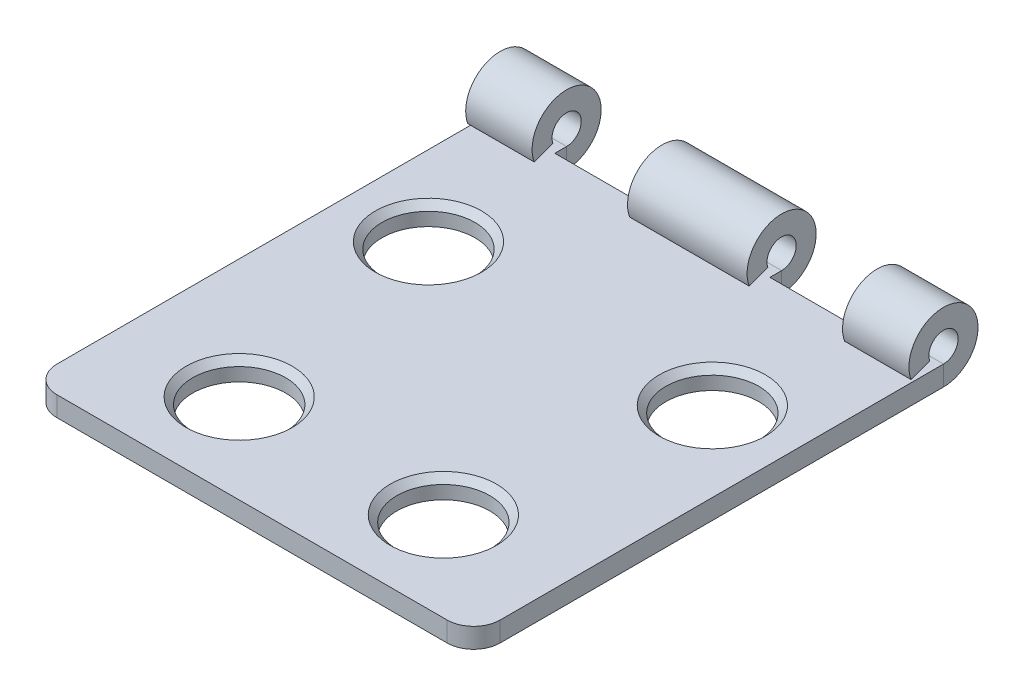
ISO-10303-21;
HEADER;
FILE_DESCRIPTION(('STEP AP214'),'2;1');
FILE_NAME('part.step','',(''),(''),'','','');
FILE_SCHEMA(('AUTOMOTIVE_DESIGN { 1 0 10303 214 1 1 1 1 }'));
ENDSEC;
DATA;
#1=APPLICATION_CONTEXT('core data for automotive mechanical design processes');
#2=APPLICATION_PROTOCOL_DEFINITION('international standard','automotive_design',2000,#1);
#3=PRODUCT_CONTEXT('',#1,'mechanical');
#4=PRODUCT('Part','Part','',(#3));
#5=PRODUCT_RELATED_PRODUCT_CATEGORY('part','',(#4));
#6=PRODUCT_DEFINITION_FORMATION('','',#4);
#7=PRODUCT_DEFINITION_CONTEXT('part definition',#1,'design');
#8=PRODUCT_DEFINITION('design','',#6,#7);
#9=PRODUCT_DEFINITION_SHAPE('','',#8);
#10=(LENGTH_UNIT() NAMED_UNIT(*) SI_UNIT(.MILLI.,.METRE.));
#11=(NAMED_UNIT(*) PLANE_ANGLE_UNIT() SI_UNIT($,.RADIAN.));
#12=(NAMED_UNIT(*) SI_UNIT($,.STERADIAN.) SOLID_ANGLE_UNIT());
#13=UNCERTAINTY_MEASURE_WITH_UNIT(LENGTH_MEASURE(1.E-05),#10,'distance_accuracy_value','');
#14=(GEOMETRIC_REPRESENTATION_CONTEXT(3) GLOBAL_UNCERTAINTY_ASSIGNED_CONTEXT((#13)) GLOBAL_UNIT_ASSIGNED_CONTEXT((#10,
#11,#12)) REPRESENTATION_CONTEXT('',''));
#15=CARTESIAN_POINT('',(0.,0.,0.));
#16=DIRECTION('',(0.,0.,1.));
#17=DIRECTION('',(1.,0.,0.));
#18=AXIS2_PLACEMENT_3D('',#15,#16,#17);
#19=CARTESIAN_POINT('',(7.47962647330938,-0.476257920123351,-7.75723216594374));
#20=DIRECTION('',(0.,1.,0.));
#21=DIRECTION('',(0.,0.,1.));
#22=AXIS2_PLACEMENT_3D('',#19,#20,#21);
#23=CONICAL_SURFACE('',#22,2.45,0.785398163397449);
#24=CARTESIAN_POINT('',(7.47962647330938,-0.126257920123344,-7.75723216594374));
#25=DIRECTION('',(0.,-1.,0.));
#26=DIRECTION('',(0.,0.,-1.));
#27=AXIS2_PLACEMENT_3D('',#24,#25,#26);
#28=CIRCLE('',#27,2.80000000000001);
#29=CARTESIAN_POINT('',(7.47962647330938,-0.126257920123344,-10.5572321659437));
#30=VERTEX_POINT('',#29);
#31=EDGE_CURVE('E249',#30,#30,#28,.T.);
#32=ORIENTED_EDGE('',*,*,#31,.F.);
#33=EDGE_LOOP('',(#32));
#34=FACE_BOUND('',#33,.T.);
#35=CARTESIAN_POINT('',(7.47962647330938,-0.476257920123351,-7.75723216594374));
#36=DIRECTION('',(0.,-1.,0.));
#37=DIRECTION('',(0.,0.,-1.));
#38=AXIS2_PLACEMENT_3D('',#35,#36,#37);
#39=CIRCLE('',#38,2.45);
#40=CARTESIAN_POINT('',(7.47962647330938,-0.476257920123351,-10.2072321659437));
#41=VERTEX_POINT('',#40);
#42=EDGE_CURVE('E313',#41,#41,#39,.F.);
#43=ORIENTED_EDGE('',*,*,#42,.F.);
#44=EDGE_LOOP('',(#43));
#45=FACE_BOUND('',#44,.T.);
#46=ADVANCED_FACE('F49',(#34,#45),#23,.F.);
#47=CARTESIAN_POINT('',(5.37962647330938,-0.47625792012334,4.31790996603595));
#48=DIRECTION('',(0.,1.,0.));
#49=DIRECTION('',(0.,0.,1.));
#50=AXIS2_PLACEMENT_3D('',#47,#48,#49);
#51=CONICAL_SURFACE('',#50,2.45,0.78539816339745);
#52=CARTESIAN_POINT('',(5.37962647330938,-0.126257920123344,4.31790996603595));
#53=DIRECTION('',(0.,-1.,0.));
#54=DIRECTION('',(0.,0.,-1.));
#55=AXIS2_PLACEMENT_3D('',#52,#53,#54);
#56=CIRCLE('',#55,2.8);
#57=CARTESIAN_POINT('',(5.37962647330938,-0.126257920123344,1.51790996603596));
#58=VERTEX_POINT('',#57);
#59=EDGE_CURVE('E252',#58,#58,#56,.T.);
#60=ORIENTED_EDGE('',*,*,#59,.F.);
#61=EDGE_LOOP('',(#60));
#62=FACE_BOUND('',#61,.T.);
#63=CARTESIAN_POINT('',(5.37962647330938,-0.47625792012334,4.31790996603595));
#64=DIRECTION('',(0.,-1.,0.));
#65=DIRECTION('',(0.,0.,-1.));
#66=AXIS2_PLACEMENT_3D('',#63,#64,#65);
#67=CIRCLE('',#66,2.45);
#68=CARTESIAN_POINT('',(5.37962647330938,-0.47625792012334,1.86790996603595));
#69=VERTEX_POINT('',#68);
#70=EDGE_CURVE('E316',#69,#69,#67,.F.);
#71=ORIENTED_EDGE('',*,*,#70,.F.);
#72=EDGE_LOOP('',(#71));
#73=FACE_BOUND('',#72,.T.);
#74=ADVANCED_FACE('F479',(#62,#73),#51,.F.);
#75=CARTESIAN_POINT('',(-5.37937352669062,-0.47625792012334,4.31790996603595));
#76=DIRECTION('',(0.,1.,0.));
#77=DIRECTION('',(0.,0.,1.));
#78=AXIS2_PLACEMENT_3D('',#75,#76,#77);
#79=CONICAL_SURFACE('',#78,2.45,0.78539816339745);
#80=CARTESIAN_POINT('',(-5.37937352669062,-0.126257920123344,4.31790996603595));
#81=DIRECTION('',(0.,-1.,0.));
#82=DIRECTION('',(0.,0.,-1.));
#83=AXIS2_PLACEMENT_3D('',#80,#81,#82);
#84=CIRCLE('',#83,2.8);
#85=CARTESIAN_POINT('',(-5.37937352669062,-0.126257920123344,1.51790996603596));
#86=VERTEX_POINT('',#85);
#87=EDGE_CURVE('E255',#86,#86,#84,.T.);
#88=ORIENTED_EDGE('',*,*,#87,.F.);
#89=EDGE_LOOP('',(#88));
#90=FACE_BOUND('',#89,.T.);
#91=CARTESIAN_POINT('',(-5.37937352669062,-0.47625792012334,4.31790996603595));
#92=DIRECTION('',(0.,-1.,0.));
#93=DIRECTION('',(0.,0.,-1.));
#94=AXIS2_PLACEMENT_3D('',#91,#92,#93);
#95=CIRCLE('',#94,2.45);
#96=CARTESIAN_POINT('',(-5.37937352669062,-0.47625792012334,1.86790996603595));
#97=VERTEX_POINT('',#96);
#98=EDGE_CURVE('E319',#97,#97,#95,.F.);
#99=ORIENTED_EDGE('',*,*,#98,.F.);
#100=EDGE_LOOP('',(#99));
#101=FACE_BOUND('',#100,.T.);
#102=ADVANCED_FACE('F485',(#90,#101),#79,.F.);
#103=CARTESIAN_POINT('',(-7.47937352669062,-0.476257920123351,-7.75723216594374));
#104=DIRECTION('',(0.,1.,0.));
#105=DIRECTION('',(0.,0.,1.));
#106=AXIS2_PLACEMENT_3D('',#103,#104,#105);
#107=CONICAL_SURFACE('',#106,2.45,0.785398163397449);
#108=CARTESIAN_POINT('',(-7.47937352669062,-0.126257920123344,-7.75723216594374));
#109=DIRECTION('',(0.,-1.,0.));
#110=DIRECTION('',(0.,0.,-1.));
#111=AXIS2_PLACEMENT_3D('',#108,#109,#110);
#112=CIRCLE('',#111,2.80000000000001);
#113=CARTESIAN_POINT('',(-7.47937352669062,-0.126257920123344,-10.5572321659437));
#114=VERTEX_POINT('',#113);
#115=EDGE_CURVE('E258',#114,#114,#112,.T.);
#116=ORIENTED_EDGE('',*,*,#115,.F.);
#117=EDGE_LOOP('',(#116));
#118=FACE_BOUND('',#117,.T.);
#119=CARTESIAN_POINT('',(-7.47937352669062,-0.476257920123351,-7.75723216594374));
#120=DIRECTION('',(0.,-1.,0.));
#121=DIRECTION('',(0.,0.,-1.));
#122=AXIS2_PLACEMENT_3D('',#119,#120,#121);
#123=CIRCLE('',#122,2.45);
#124=CARTESIAN_POINT('',(-7.47937352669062,-0.476257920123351,-10.2072321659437));
#125=VERTEX_POINT('',#124);
#126=EDGE_CURVE('E322',#125,#125,#123,.F.);
#127=ORIENTED_EDGE('',*,*,#126,.F.);
#128=EDGE_LOOP('',(#127));
#129=FACE_BOUND('',#128,.T.);
#130=ADVANCED_FACE('F493',(#118,#129),#107,.F.);
#131=CARTESIAN_POINT('',(-7.47937352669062,-1.17625792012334,-7.75723216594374));
#132=DIRECTION('',(0.,1.,0.));
#133=DIRECTION('',(0.,0.,1.));
#134=AXIS2_PLACEMENT_3D('',#131,#132,#133);
#135=CYLINDRICAL_SURFACE('',#134,2.45);
#136=ORIENTED_EDGE('',*,*,#126,.T.);
#137=EDGE_LOOP('',(#136));
#138=FACE_BOUND('',#137,.T.);
#139=CARTESIAN_POINT('',(-7.47937352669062,-1.17625792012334,-7.75723216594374));
#140=DIRECTION('',(0.,1.,0.));
#141=DIRECTION('',(0.,0.,1.));
#142=AXIS2_PLACEMENT_3D('',#139,#140,#141);
#143=CIRCLE('',#142,2.45);
#144=CARTESIAN_POINT('',(-7.47937352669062,-1.17625792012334,-5.30723216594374));
#145=VERTEX_POINT('',#144);
#146=EDGE_CURVE('E267',#145,#145,#143,.T.);
#147=ORIENTED_EDGE('',*,*,#146,.F.);
#148=EDGE_LOOP('',(#147));
#149=FACE_BOUND('',#148,.T.);
#150=ADVANCED_FACE('F497',(#138,#149),#135,.F.);
#151=CARTESIAN_POINT('',(-5.37937352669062,-1.17625792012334,4.31790996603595));
#152=DIRECTION('',(0.,1.,0.));
#153=DIRECTION('',(0.,0.,1.));
#154=AXIS2_PLACEMENT_3D('',#151,#152,#153);
#155=CYLINDRICAL_SURFACE('',#154,2.45);
#156=ORIENTED_EDGE('',*,*,#98,.T.);
#157=EDGE_LOOP('',(#156));
#158=FACE_BOUND('',#157,.T.);
#159=CARTESIAN_POINT('',(-5.37937352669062,-1.17625792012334,4.31790996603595));
#160=DIRECTION('',(0.,1.,0.));
#161=DIRECTION('',(0.,0.,1.));
#162=AXIS2_PLACEMENT_3D('',#159,#160,#161);
#163=CIRCLE('',#162,2.45);
#164=CARTESIAN_POINT('',(-5.37937352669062,-1.17625792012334,6.76790996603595));
#165=VERTEX_POINT('',#164);
#166=EDGE_CURVE('E270',#165,#165,#163,.T.);
#167=ORIENTED_EDGE('',*,*,#166,.F.);
#168=EDGE_LOOP('',(#167));
#169=FACE_BOUND('',#168,.T.);
#170=ADVANCED_FACE('F501',(#158,#169),#155,.F.);
#171=CARTESIAN_POINT('',(5.37962647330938,-1.17625792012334,4.31790996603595));
#172=DIRECTION('',(0.,1.,0.));
#173=DIRECTION('',(0.,0.,1.));
#174=AXIS2_PLACEMENT_3D('',#171,#172,#173);
#175=CYLINDRICAL_SURFACE('',#174,2.45);
#176=ORIENTED_EDGE('',*,*,#70,.T.);
#177=EDGE_LOOP('',(#176));
#178=FACE_BOUND('',#177,.T.);
#179=CARTESIAN_POINT('',(5.37962647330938,-1.17625792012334,4.31790996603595));
#180=DIRECTION('',(0.,1.,0.));
#181=DIRECTION('',(0.,0.,-1.));
#182=AXIS2_PLACEMENT_3D('',#179,#180,#181);
#183=CIRCLE('',#182,2.45);
#184=CARTESIAN_POINT('',(5.37962647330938,-1.17625792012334,1.86790996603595));
#185=VERTEX_POINT('',#184);
#186=EDGE_CURVE('E273',#185,#185,#183,.T.);
#187=ORIENTED_EDGE('',*,*,#186,.F.);
#188=EDGE_LOOP('',(#187));
#189=FACE_BOUND('',#188,.T.);
#190=ADVANCED_FACE('F505',(#178,#189),#175,.F.);
#191=CARTESIAN_POINT('',(7.47962647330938,-1.17625792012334,-7.75723216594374));
#192=DIRECTION('',(0.,1.,0.));
#193=DIRECTION('',(0.,0.,1.));
#194=AXIS2_PLACEMENT_3D('',#191,#192,#193);
#195=CYLINDRICAL_SURFACE('',#194,2.45);
#196=ORIENTED_EDGE('',*,*,#42,.T.);
#197=EDGE_LOOP('',(#196));
#198=FACE_BOUND('',#197,.T.);
#199=CARTESIAN_POINT('',(7.47962647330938,-1.17625792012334,-7.75723216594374));
#200=DIRECTION('',(0.,1.,0.));
#201=DIRECTION('',(0.,0.,-1.));
#202=AXIS2_PLACEMENT_3D('',#199,#200,#201);
#203=CIRCLE('',#202,2.45);
#204=CARTESIAN_POINT('',(7.47962647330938,-1.17625792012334,-10.2072321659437));
#205=VERTEX_POINT('',#204);
#206=EDGE_CURVE('E276',#205,#205,#203,.T.);
#207=ORIENTED_EDGE('',*,*,#206,.F.);
#208=EDGE_LOOP('',(#207));
#209=FACE_BOUND('',#208,.T.);
#210=ADVANCED_FACE('F509',(#198,#209),#195,.F.);
#211=CARTESIAN_POINT('',(3.15012647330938,-3.62625792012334,-15.1204572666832));
#212=DIRECTION('',(0.,0.,1.));
#213=DIRECTION('',(1.,0.,0.));
#214=AXIS2_PLACEMENT_3D('',#211,#212,#213);
#215=PLANE('',#214);
#216=DIRECTION('',(-1.,0.,0.));
#217=VECTOR('',#216,1.);
#218=CARTESIAN_POINT('',(-10.2793735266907,-1.17625792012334,-15.1204572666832));
#219=LINE('',#218,#217);
#220=CARTESIAN_POINT('',(8.17962647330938,-1.17625792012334,-15.1204572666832));
#221=VERTEX_POINT('',#220);
#222=CARTESIAN_POINT('',(3.15012647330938,-1.17625792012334,-15.1204572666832));
#223=VERTEX_POINT('',#222);
#224=EDGE_CURVE('E311',#221,#223,#219,.T.);
#225=ORIENTED_EDGE('',*,*,#224,.T.);
#226=DIRECTION('',(0.,1.,0.));
#227=VECTOR('',#226,1.);
#228=CARTESIAN_POINT('',(3.15012647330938,-3.62625792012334,-15.1204572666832));
#229=LINE('',#228,#227);
#230=CARTESIAN_POINT('',(3.15012647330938,-0.126257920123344,-15.1204572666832));
#231=VERTEX_POINT('',#230);
#232=EDGE_CURVE('E309',#223,#231,#229,.T.);
#233=ORIENTED_EDGE('',*,*,#232,.T.);
#234=DIRECTION('',(1.,0.,0.));
#235=VECTOR('',#234,1.);
#236=CARTESIAN_POINT('',(3.15012647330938,-0.126257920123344,-15.1204572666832));
#237=LINE('',#236,#235);
#238=CARTESIAN_POINT('',(8.17962647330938,-0.126257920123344,-15.1204572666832));
#239=VERTEX_POINT('',#238);
#240=EDGE_CURVE('E307',#231,#239,#237,.T.);
#241=ORIENTED_EDGE('',*,*,#240,.T.);
#242=DIRECTION('',(0.,1.,0.));
#243=VECTOR('',#242,1.);
#244=CARTESIAN_POINT('',(8.17962647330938,-3.62625792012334,-15.1204572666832));
#245=LINE('',#244,#243);
#246=EDGE_CURVE('E68',#221,#239,#245,.T.);
#247=ORIENTED_EDGE('',*,*,#246,.F.);
#248=EDGE_LOOP('',(#225,#233,#241,#247));
#249=FACE_BOUND('',#248,.T.);
#250=ADVANCED_FACE('F463',(#249),#215,.F.);
#251=CARTESIAN_POINT('',(-8.17937352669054,-3.62625792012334,-15.1144574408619));
#252=DIRECTION('',(0.,0.,1.));
#253=DIRECTION('',(1.,0.,0.));
#254=AXIS2_PLACEMENT_3D('',#251,#252,#253);
#255=PLANE('',#254);
#256=DIRECTION('',(-1.,0.,0.));
#257=VECTOR('',#256,1.);
#258=CARTESIAN_POINT('',(-10.2793735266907,-1.17625792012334,-15.1144574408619));
#259=LINE('',#258,#257);
#260=CARTESIAN_POINT('',(-3.14987352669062,-1.17625792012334,-15.1144574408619));
#261=VERTEX_POINT('',#260);
#262=CARTESIAN_POINT('',(-8.17937352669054,-1.17625792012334,-15.1144574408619));
#263=VERTEX_POINT('',#262);
#264=EDGE_CURVE('E305',#261,#263,#259,.T.);
#265=ORIENTED_EDGE('',*,*,#264,.T.);
#266=DIRECTION('',(0.,1.,0.));
#267=VECTOR('',#266,1.);
#268=CARTESIAN_POINT('',(-8.17937352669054,-3.62625792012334,-15.1144574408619));
#269=LINE('',#268,#267);
#270=CARTESIAN_POINT('',(-8.17937352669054,-0.126257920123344,-15.1144574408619));
#271=VERTEX_POINT('',#270);
#272=EDGE_CURVE('E303',#263,#271,#269,.T.);
#273=ORIENTED_EDGE('',*,*,#272,.T.);
#274=DIRECTION('',(1.,0.,0.));
#275=VECTOR('',#274,1.);
#276=CARTESIAN_POINT('',(-8.17937352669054,-0.126257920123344,-15.1144574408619));
#277=LINE('',#276,#275);
#278=CARTESIAN_POINT('',(-3.14987352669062,-0.126257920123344,-15.1144574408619));
#279=VERTEX_POINT('',#278);
#280=EDGE_CURVE('E300',#271,#279,#277,.T.);
#281=ORIENTED_EDGE('',*,*,#280,.T.);
#282=DIRECTION('',(0.,1.,0.));
#283=VECTOR('',#282,1.);
#284=CARTESIAN_POINT('',(-3.14987352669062,-3.62625792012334,-15.1144574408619));
#285=LINE('',#284,#283);
#286=EDGE_CURVE('E241',#261,#279,#285,.T.);
#287=ORIENTED_EDGE('',*,*,#286,.F.);
#288=EDGE_LOOP('',(#265,#273,#281,#287));
#289=FACE_BOUND('',#288,.T.);
#290=ADVANCED_FACE('F399',(#289),#255,.F.);
#291=CARTESIAN_POINT('',(-10.2793735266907,-7.12625792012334,7.62176783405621));
#292=DIRECTION('',(0.,1.,0.));
#293=DIRECTION('',(0.,0.,1.));
#294=AXIS2_PLACEMENT_3D('',#291,#292,#293);
#295=CYLINDRICAL_SURFACE('',#294,1.4);
#296=CARTESIAN_POINT('',(-10.2793735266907,-1.17625792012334,7.62176783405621));
#297=DIRECTION('',(0.,-1.,0.));
#298=DIRECTION('',(0.,0.,-1.));
#299=AXIS2_PLACEMENT_3D('',#296,#297,#298);
#300=CIRCLE('',#299,1.4);
#301=CARTESIAN_POINT('',(-10.2793735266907,-1.17625792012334,9.02176783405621));
#302=VERTEX_POINT('',#301);
#303=CARTESIAN_POINT('',(-11.6793735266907,-1.17625792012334,7.62176783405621));
#304=VERTEX_POINT('',#303);
#305=EDGE_CURVE('E286',#302,#304,#300,.T.);
#306=ORIENTED_EDGE('',*,*,#305,.F.);
#307=DIRECTION('',(0.,1.,0.));
#308=VECTOR('',#307,1.);
#309=CARTESIAN_POINT('',(-10.2793735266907,-7.12625792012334,9.02176783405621));
#310=LINE('',#309,#308);
#311=CARTESIAN_POINT('',(-10.2793735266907,-0.126257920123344,9.02176783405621));
#312=VERTEX_POINT('',#311);
#313=EDGE_CURVE('E290',#312,#302,#310,.F.);
#314=ORIENTED_EDGE('',*,*,#313,.F.);
#315=CARTESIAN_POINT('',(-10.2793735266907,-0.126257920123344,7.62176783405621));
#316=DIRECTION('',(0.,-1.,0.));
#317=DIRECTION('',(0.,0.,-1.));
#318=AXIS2_PLACEMENT_3D('',#315,#316,#317);
#319=CIRCLE('',#318,1.4);
#320=CARTESIAN_POINT('',(-11.6793735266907,-0.126257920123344,7.62176783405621));
#321=VERTEX_POINT('',#320);
#322=EDGE_CURVE('E245',#321,#312,#319,.F.);
#323=ORIENTED_EDGE('',*,*,#322,.F.);
#324=DIRECTION('',(0.,1.,0.));
#325=VECTOR('',#324,1.);
#326=CARTESIAN_POINT('',(-11.6793735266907,-7.12625792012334,7.62176783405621));
#327=LINE('',#326,#325);
#328=EDGE_CURVE('E59',#304,#321,#327,.T.);
#329=ORIENTED_EDGE('',*,*,#328,.F.);
#330=EDGE_LOOP('',(#306,#314,#323,#329));
#331=FACE_BOUND('',#330,.T.);
#332=ADVANCED_FACE('F518',(#331),#295,.T.);
#333=CARTESIAN_POINT('',(-11.6793735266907,-7.12625792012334,9.02176783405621));
#334=DIRECTION('',(0.,0.,-1.));
#335=DIRECTION('',(-1.,0.,0.));
#336=AXIS2_PLACEMENT_3D('',#333,#334,#335);
#337=PLANE('',#336);
#338=DIRECTION('',(1.,0.,0.));
#339=VECTOR('',#338,1.);
#340=CARTESIAN_POINT('',(-10.2793735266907,-1.17625792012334,9.02176783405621));
#341=LINE('',#340,#339);
#342=CARTESIAN_POINT('',(10.2796264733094,-1.17625792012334,9.02176783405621));
#343=VERTEX_POINT('',#342);
#344=EDGE_CURVE('E297',#302,#343,#341,.T.);
#345=ORIENTED_EDGE('',*,*,#344,.T.);
#346=DIRECTION('',(0.,-1.,0.));
#347=VECTOR('',#346,1.);
#348=CARTESIAN_POINT('',(10.2796264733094,-7.12625792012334,9.02176783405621));
#349=LINE('',#348,#347);
#350=CARTESIAN_POINT('',(10.2796264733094,-0.126257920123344,9.02176783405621));
#351=VERTEX_POINT('',#350);
#352=EDGE_CURVE('E295',#343,#351,#349,.F.);
#353=ORIENTED_EDGE('',*,*,#352,.T.);
#354=DIRECTION('',(-1.,0.,0.));
#355=VECTOR('',#354,1.);
#356=CARTESIAN_POINT('',(-11.6793735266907,-0.126257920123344,9.02176783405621));
#357=LINE('',#356,#355);
#358=EDGE_CURVE('E292',#351,#312,#357,.T.);
#359=ORIENTED_EDGE('',*,*,#358,.T.);
#360=ORIENTED_EDGE('',*,*,#313,.T.);
#361=EDGE_LOOP('',(#345,#353,#359,#360));
#362=FACE_BOUND('',#361,.T.);
#363=ADVANCED_FACE('F521',(#362),#337,.F.);
#364=CARTESIAN_POINT('',(10.2796264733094,-7.12625792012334,7.62176783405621));
#365=DIRECTION('',(0.,-1.,0.));
#366=DIRECTION('',(0.,0.,-1.));
#367=AXIS2_PLACEMENT_3D('',#364,#365,#366);
#368=CYLINDRICAL_SURFACE('',#367,1.4);
#369=CARTESIAN_POINT('',(10.2796264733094,-0.126257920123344,7.62176783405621));
#370=DIRECTION('',(0.,-1.,0.));
#371=DIRECTION('',(0.,0.,-1.));
#372=AXIS2_PLACEMENT_3D('',#369,#370,#371);
#373=CIRCLE('',#372,1.4);
#374=CARTESIAN_POINT('',(11.6796264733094,-0.126257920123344,7.62176783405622));
#375=VERTEX_POINT('',#374);
#376=EDGE_CURVE('E247',#351,#375,#373,.F.);
#377=ORIENTED_EDGE('',*,*,#376,.F.);
#378=ORIENTED_EDGE('',*,*,#352,.F.);
#379=CARTESIAN_POINT('',(10.2796264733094,-1.17625792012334,7.62176783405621));
#380=DIRECTION('',(0.,-1.,0.));
#381=DIRECTION('',(0.,0.,-1.));
#382=AXIS2_PLACEMENT_3D('',#379,#380,#381);
#383=CIRCLE('',#382,1.4);
#384=CARTESIAN_POINT('',(11.6796264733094,-1.17625792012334,7.62176783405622));
#385=VERTEX_POINT('',#384);
#386=EDGE_CURVE('E288',#385,#343,#383,.T.);
#387=ORIENTED_EDGE('',*,*,#386,.F.);
#388=DIRECTION('',(0.,-1.,0.));
#389=VECTOR('',#388,1.);
#390=CARTESIAN_POINT('',(11.6796264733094,-7.12625792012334,7.62176783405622));
#391=LINE('',#390,#389);
#392=EDGE_CURVE('E233',#375,#385,#391,.T.);
#393=ORIENTED_EDGE('',*,*,#392,.F.);
#394=EDGE_LOOP('',(#377,#378,#387,#393));
#395=FACE_BOUND('',#394,.T.);
#396=ADVANCED_FACE('F525',(#395),#368,.T.);
#397=CARTESIAN_POINT('',(-10.2793735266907,-1.17625792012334,10.1417678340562));
#398=DIRECTION('',(0.,-1.,0.));
#399=DIRECTION('',(0.,0.,-1.));
#400=AXIS2_PLACEMENT_3D('',#397,#398,#399);
#401=PLANE('',#400);
#402=DIRECTION('',(0.,0.,-1.));
#403=VECTOR('',#402,1.);
#404=CARTESIAN_POINT('',(11.6796264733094,-1.17625792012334,10.1417678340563));
#405=LINE('',#404,#403);
#406=CARTESIAN_POINT('',(11.6796264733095,-1.17625792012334,-15.7372321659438));
#407=VERTEX_POINT('',#406);
#408=EDGE_CURVE('E230',#385,#407,#405,.T.);
#409=ORIENTED_EDGE('',*,*,#408,.F.);
#410=ORIENTED_EDGE('',*,*,#386,.T.);
#411=ORIENTED_EDGE('',*,*,#344,.F.);
#412=ORIENTED_EDGE('',*,*,#305,.T.);
#413=DIRECTION('',(0.,0.,1.));
#414=VECTOR('',#413,1.);
#415=CARTESIAN_POINT('',(-11.6793735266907,-1.17625792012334,10.1417678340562));
#416=LINE('',#415,#414);
#417=CARTESIAN_POINT('',(-11.6793735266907,-1.17625792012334,-15.7372321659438));
#418=VERTEX_POINT('',#417);
#419=EDGE_CURVE('E147',#418,#304,#416,.T.);
#420=ORIENTED_EDGE('',*,*,#419,.F.);
#421=DIRECTION('',(1.,0.,0.));
#422=VECTOR('',#421,1.);
#423=CARTESIAN_POINT('',(-14.4793735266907,-1.17625792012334,-15.7372321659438));
#424=LINE('',#423,#422);
#425=CARTESIAN_POINT('',(-8.17937352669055,-1.17625792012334,-15.7372321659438));
#426=VERTEX_POINT('',#425);
#427=EDGE_CURVE('E284',#418,#426,#424,.T.);
#428=ORIENTED_EDGE('',*,*,#427,.T.);
#429=DIRECTION('',(0.,0.,-1.));
#430=VECTOR('',#429,1.);
#431=CARTESIAN_POINT('',(-8.17937352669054,-1.17625792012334,10.1417678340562));
#432=LINE('',#431,#430);
#433=EDGE_CURVE('E177',#263,#426,#432,.T.);
#434=ORIENTED_EDGE('',*,*,#433,.F.);
#435=ORIENTED_EDGE('',*,*,#264,.F.);
#436=DIRECTION('',(0.,0.,1.));
#437=VECTOR('',#436,1.);
#438=CARTESIAN_POINT('',(-3.14987352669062,-1.17625792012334,10.1417678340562));
#439=LINE('',#438,#437);
#440=CARTESIAN_POINT('',(-3.14987352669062,-1.17625792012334,-15.7372321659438));
#441=VERTEX_POINT('',#440);
#442=EDGE_CURVE('E243',#441,#261,#439,.T.);
#443=ORIENTED_EDGE('',*,*,#442,.F.);
#444=DIRECTION('',(1.,0.,0.));
#445=VECTOR('',#444,1.);
#446=CARTESIAN_POINT('',(-14.4793735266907,-1.17625792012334,-15.7372321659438));
#447=LINE('',#446,#445);
#448=CARTESIAN_POINT('',(3.15012647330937,-1.17625792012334,-15.7372321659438));
#449=VERTEX_POINT('',#448);
#450=EDGE_CURVE('E281',#441,#449,#447,.T.);
#451=ORIENTED_EDGE('',*,*,#450,.T.);
#452=DIRECTION('',(0.,0.,-1.));
#453=VECTOR('',#452,1.);
#454=CARTESIAN_POINT('',(3.15012647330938,-1.17625792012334,10.1417678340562));
#455=LINE('',#454,#453);
#456=EDGE_CURVE('E261',#223,#449,#455,.T.);
#457=ORIENTED_EDGE('',*,*,#456,.F.);
#458=ORIENTED_EDGE('',*,*,#224,.F.);
#459=DIRECTION('',(0.,0.,1.));
#460=VECTOR('',#459,1.);
#461=CARTESIAN_POINT('',(8.17962647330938,-1.17625792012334,10.1417678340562));
#462=LINE('',#461,#460);
#463=CARTESIAN_POINT('',(8.17962647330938,-1.17625792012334,-15.7372321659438));
#464=VERTEX_POINT('',#463);
#465=EDGE_CURVE('E228',#464,#221,#462,.T.);
#466=ORIENTED_EDGE('',*,*,#465,.F.);
#467=DIRECTION('',(1.,0.,0.));
#468=VECTOR('',#467,1.);
#469=CARTESIAN_POINT('',(-14.4793735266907,-1.17625792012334,-15.7372321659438));
#470=LINE('',#469,#468);
#471=EDGE_CURVE('E279',#464,#407,#470,.T.);
#472=ORIENTED_EDGE('',*,*,#471,.T.);
#473=EDGE_LOOP('',(#409,#410,#411,#412,#420,#428,#434,#435,#443,#451,#457,#458,#466,#472));
#474=FACE_BOUND('',#473,.T.);
#475=ORIENTED_EDGE('',*,*,#206,.T.);
#476=EDGE_LOOP('',(#475));
#477=FACE_BOUND('',#476,.T.);
#478=ORIENTED_EDGE('',*,*,#186,.T.);
#479=EDGE_LOOP('',(#478));
#480=FACE_BOUND('',#479,.T.);
#481=ORIENTED_EDGE('',*,*,#166,.T.);
#482=EDGE_LOOP('',(#481));
#483=FACE_BOUND('',#482,.T.);
#484=ORIENTED_EDGE('',*,*,#146,.T.);
#485=EDGE_LOOP('',(#484));
#486=FACE_BOUND('',#485,.T.);
#487=ADVANCED_FACE('F402',(#474,#477,#480,#483,#486),#401,.T.);
#488=CARTESIAN_POINT('',(3.15012647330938,-3.62625792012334,-22.2918161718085));
#489=DIRECTION('',(-1.,0.,0.));
#490=DIRECTION('',(0.,0.,1.));
#491=AXIS2_PLACEMENT_3D('',#488,#489,#490);
#492=PLANE('',#491);
#493=DIRECTION('',(0.,-1.,0.));
#494=VECTOR('',#493,1.);
#495=CARTESIAN_POINT('',(3.15012647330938,-0.126257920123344,-15.7372321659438));
#496=LINE('',#495,#494);
#497=CARTESIAN_POINT('',(3.15012647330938,-0.126257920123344,-15.7372321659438));
#498=VERTEX_POINT('',#497);
#499=EDGE_CURVE('E325',#498,#449,#496,.T.);
#500=ORIENTED_EDGE('',*,*,#499,.F.);
#501=DIRECTION('',(0.,0.,1.));
#502=VECTOR('',#501,1.);
#503=CARTESIAN_POINT('',(3.15012647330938,-0.126257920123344,-22.2918161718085));
#504=LINE('',#503,#502);
#505=EDGE_CURVE('E264',#498,#231,#504,.T.);
#506=ORIENTED_EDGE('',*,*,#505,.T.);
#507=ORIENTED_EDGE('',*,*,#232,.F.);
#508=ORIENTED_EDGE('',*,*,#456,.T.);
#509=EDGE_LOOP('',(#500,#506,#507,#508));
#510=FACE_BOUND('',#509,.T.);
#511=ADVANCED_FACE('F457',(#510),#492,.F.);
#512=CARTESIAN_POINT('',(-10.2793735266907,-0.126257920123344,10.1417678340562));
#513=DIRECTION('',(0.,-1.,0.));
#514=DIRECTION('',(0.,0.,-1.));
#515=AXIS2_PLACEMENT_3D('',#512,#513,#514);
#516=PLANE('',#515);
#517=ORIENTED_EDGE('',*,*,#115,.T.);
#518=EDGE_LOOP('',(#517));
#519=FACE_BOUND('',#518,.T.);
#520=ORIENTED_EDGE('',*,*,#87,.T.);
#521=EDGE_LOOP('',(#520));
#522=FACE_BOUND('',#521,.T.);
#523=ORIENTED_EDGE('',*,*,#59,.T.);
#524=EDGE_LOOP('',(#523));
#525=FACE_BOUND('',#524,.T.);
#526=ORIENTED_EDGE('',*,*,#31,.T.);
#527=EDGE_LOOP('',(#526));
#528=FACE_BOUND('',#527,.T.);
#529=ORIENTED_EDGE('',*,*,#358,.F.);
#530=ORIENTED_EDGE('',*,*,#376,.T.);
#531=DIRECTION('',(0.,0.,1.));
#532=VECTOR('',#531,1.);
#533=CARTESIAN_POINT('',(11.6796264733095,-0.126257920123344,-17.5572321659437));
#534=LINE('',#533,#532);
#535=CARTESIAN_POINT('',(11.6796264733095,-0.126257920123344,-15.7372321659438));
#536=VERTEX_POINT('',#535);
#537=EDGE_CURVE('E236',#536,#375,#534,.T.);
#538=ORIENTED_EDGE('',*,*,#537,.F.);
#539=DIRECTION('',(1.,0.,0.));
#540=VECTOR('',#539,1.);
#541=CARTESIAN_POINT('',(-14.4793735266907,-0.126257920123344,-15.7372321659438));
#542=LINE('',#541,#540);
#543=CARTESIAN_POINT('',(8.17962647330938,-0.126257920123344,-15.7372321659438));
#544=VERTEX_POINT('',#543);
#545=EDGE_CURVE('E335',#544,#536,#542,.T.);
#546=ORIENTED_EDGE('',*,*,#545,.F.);
#547=DIRECTION('',(0.,0.,-1.));
#548=VECTOR('',#547,1.);
#549=CARTESIAN_POINT('',(8.17962647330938,-0.126257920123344,-22.2918161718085));
#550=LINE('',#549,#548);
#551=EDGE_CURVE('E225',#239,#544,#550,.T.);
#552=ORIENTED_EDGE('',*,*,#551,.F.);
#553=ORIENTED_EDGE('',*,*,#240,.F.);
#554=ORIENTED_EDGE('',*,*,#505,.F.);
#555=DIRECTION('',(1.,0.,0.));
#556=VECTOR('',#555,1.);
#557=CARTESIAN_POINT('',(-14.4793735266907,-0.126257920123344,-15.7372321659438));
#558=LINE('',#557,#556);
#559=CARTESIAN_POINT('',(-3.14987352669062,-0.126257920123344,-15.7372321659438));
#560=VERTEX_POINT('',#559);
#561=EDGE_CURVE('E328',#560,#498,#558,.T.);
#562=ORIENTED_EDGE('',*,*,#561,.F.);
#563=DIRECTION('',(0.,0.,-1.));
#564=VECTOR('',#563,1.);
#565=CARTESIAN_POINT('',(-3.14987352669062,-0.126257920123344,-22.2918161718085));
#566=LINE('',#565,#564);
#567=EDGE_CURVE('E239',#279,#560,#566,.T.);
#568=ORIENTED_EDGE('',*,*,#567,.F.);
#569=ORIENTED_EDGE('',*,*,#280,.F.);
#570=DIRECTION('',(0.,0.,1.));
#571=VECTOR('',#570,1.);
#572=CARTESIAN_POINT('',(-8.17937352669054,-0.126257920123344,-22.2918161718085));
#573=LINE('',#572,#571);
#574=CARTESIAN_POINT('',(-8.17937352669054,-0.126257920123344,-15.7372321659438));
#575=VERTEX_POINT('',#574);
#576=EDGE_CURVE('E222',#575,#271,#573,.T.);
#577=ORIENTED_EDGE('',*,*,#576,.F.);
#578=DIRECTION('',(1.,0.,0.));
#579=VECTOR('',#578,1.);
#580=CARTESIAN_POINT('',(-14.4793735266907,-0.126257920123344,-15.7372321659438));
#581=LINE('',#580,#579);
#582=CARTESIAN_POINT('',(-11.6793735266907,-0.126257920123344,-15.7372321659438));
#583=VERTEX_POINT('',#582);
#584=EDGE_CURVE('E343',#583,#575,#581,.T.);
#585=ORIENTED_EDGE('',*,*,#584,.F.);
#586=DIRECTION('',(0.,0.,-1.));
#587=VECTOR('',#586,1.);
#588=CARTESIAN_POINT('',(-11.6793735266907,-0.126257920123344,-17.5572321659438));
#589=LINE('',#588,#587);
#590=EDGE_CURVE('E12',#321,#583,#589,.T.);
#591=ORIENTED_EDGE('',*,*,#590,.F.);
#592=ORIENTED_EDGE('',*,*,#322,.T.);
#593=EDGE_LOOP('',(#529,#530,#538,#546,#552,#553,#554,#562,#568,#569,#577,#585,#591,#592));
#594=FACE_BOUND('',#593,.T.);
#595=ADVANCED_FACE('F395',(#519,#522,#525,#528,#594),#516,.F.);
#596=CARTESIAN_POINT('',(-3.14987352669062,-3.62625792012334,-22.2918161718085));
#597=DIRECTION('',(1.,0.,0.));
#598=DIRECTION('',(0.,0.,-1.));
#599=AXIS2_PLACEMENT_3D('',#596,#597,#598);
#600=PLANE('',#599);
#601=DIRECTION('',(0.,1.,0.));
#602=VECTOR('',#601,1.);
#603=CARTESIAN_POINT('',(-3.14987352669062,-1.17625792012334,-15.7372321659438));
#604=LINE('',#603,#602);
#605=EDGE_CURVE('E331',#441,#560,#604,.T.);
#606=ORIENTED_EDGE('',*,*,#605,.F.);
#607=ORIENTED_EDGE('',*,*,#442,.T.);
#608=ORIENTED_EDGE('',*,*,#286,.T.);
#609=ORIENTED_EDGE('',*,*,#567,.T.);
#610=EDGE_LOOP('',(#606,#607,#608,#609));
#611=FACE_BOUND('',#610,.T.);
#612=ADVANCED_FACE('F409',(#611),#600,.F.);
#613=CARTESIAN_POINT('',(11.6796264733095,-7.12625792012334,-17.5572321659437));
#614=DIRECTION('',(-1.,0.,0.));
#615=DIRECTION('',(0.,0.,1.));
#616=AXIS2_PLACEMENT_3D('',#613,#614,#615);
#617=PLANE('',#616);
#618=DIRECTION('',(0.,-1.,0.));
#619=VECTOR('',#618,1.);
#620=CARTESIAN_POINT('',(11.6796264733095,-0.126257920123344,-15.7372321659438));
#621=LINE('',#620,#619);
#622=EDGE_CURVE('E203',#536,#407,#621,.T.);
#623=ORIENTED_EDGE('',*,*,#622,.F.);
#624=ORIENTED_EDGE('',*,*,#537,.T.);
#625=ORIENTED_EDGE('',*,*,#392,.T.);
#626=ORIENTED_EDGE('',*,*,#408,.T.);
#627=EDGE_LOOP('',(#623,#624,#625,#626));
#628=FACE_BOUND('',#627,.T.);
#629=ADVANCED_FACE('F539',(#628),#617,.F.);
#630=CARTESIAN_POINT('',(8.17962647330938,-3.62625792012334,-22.2918161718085));
#631=DIRECTION('',(1.,0.,0.));
#632=DIRECTION('',(0.,0.,-1.));
#633=AXIS2_PLACEMENT_3D('',#630,#631,#632);
#634=PLANE('',#633);
#635=DIRECTION('',(0.,1.,0.));
#636=VECTOR('',#635,1.);
#637=CARTESIAN_POINT('',(8.17962647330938,-1.17625792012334,-15.7372321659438));
#638=LINE('',#637,#636);
#639=EDGE_CURVE('E338',#464,#544,#638,.T.);
#640=ORIENTED_EDGE('',*,*,#639,.F.);
#641=ORIENTED_EDGE('',*,*,#465,.T.);
#642=ORIENTED_EDGE('',*,*,#246,.T.);
#643=ORIENTED_EDGE('',*,*,#551,.T.);
#644=EDGE_LOOP('',(#640,#641,#642,#643));
#645=FACE_BOUND('',#644,.T.);
#646=ADVANCED_FACE('F466',(#645),#634,.F.);
#647=CARTESIAN_POINT('',(-8.17937352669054,-3.62625792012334,-22.2918161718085));
#648=DIRECTION('',(-1.,0.,0.));
#649=DIRECTION('',(0.,0.,1.));
#650=AXIS2_PLACEMENT_3D('',#647,#648,#649);
#651=PLANE('',#650);
#652=DIRECTION('',(0.,-1.,0.));
#653=VECTOR('',#652,1.);
#654=CARTESIAN_POINT('',(-8.17937352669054,-0.126257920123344,-15.7372321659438));
#655=LINE('',#654,#653);
#656=EDGE_CURVE('E341',#575,#426,#655,.T.);
#657=ORIENTED_EDGE('',*,*,#656,.F.);
#658=ORIENTED_EDGE('',*,*,#576,.T.);
#659=ORIENTED_EDGE('',*,*,#272,.F.);
#660=ORIENTED_EDGE('',*,*,#433,.T.);
#661=EDGE_LOOP('',(#657,#658,#659,#660));
#662=FACE_BOUND('',#661,.T.);
#663=ADVANCED_FACE('F390',(#662),#651,.F.);
#664=CARTESIAN_POINT('',(-11.6793735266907,-7.12625792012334,-17.5572321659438));
#665=DIRECTION('',(1.,0.,0.));
#666=DIRECTION('',(0.,0.,-1.));
#667=AXIS2_PLACEMENT_3D('',#664,#665,#666);
#668=PLANE('',#667);
#669=DIRECTION('',(0.,1.,0.));
#670=VECTOR('',#669,1.);
#671=CARTESIAN_POINT('',(-11.6793735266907,-1.17625792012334,-15.7372321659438));
#672=LINE('',#671,#670);
#673=EDGE_CURVE('E53',#418,#583,#672,.T.);
#674=ORIENTED_EDGE('',*,*,#673,.F.);
#675=ORIENTED_EDGE('',*,*,#419,.T.);
#676=ORIENTED_EDGE('',*,*,#328,.T.);
#677=ORIENTED_EDGE('',*,*,#590,.T.);
#678=EDGE_LOOP('',(#674,#675,#676,#677));
#679=FACE_BOUND('',#678,.T.);
#680=ADVANCED_FACE('F51',(#679),#668,.F.);
#681=CARTESIAN_POINT('',(11.6796264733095,0.643742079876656,-15.7372321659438));
#682=DIRECTION('',(1.,0.,0.));
#683=DIRECTION('',(0.,0.,-1.));
#684=AXIS2_PLACEMENT_3D('',#681,#682,#683);
#685=PLANE('',#684);
#686=DIRECTION('',(0.,-0.342020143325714,0.939692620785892));
#687=VECTOR('',#686,1.);
#688=CARTESIAN_POINT('',(11.6796264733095,0.0212654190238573,-14.0269915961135));
#689=LINE('',#688,#687);
#690=CARTESIAN_POINT('',(11.6796264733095,0.380386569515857,-15.0136688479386));
#691=VERTEX_POINT('',#690);
#692=CARTESIAN_POINT('',(11.6796264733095,0.0212654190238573,-14.0269915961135));
#693=VERTEX_POINT('',#692);
#694=EDGE_CURVE('E168',#691,#693,#689,.T.);
#695=ORIENTED_EDGE('',*,*,#694,.F.);
#696=CARTESIAN_POINT('',(11.6796264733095,0.643742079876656,-15.7372321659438));
#697=DIRECTION('',(1.,0.,0.));
#698=DIRECTION('',(0.,0.,-1.));
#699=AXIS2_PLACEMENT_3D('',#696,#697,#698);
#700=CIRCLE('',#699,0.77);
#701=EDGE_CURVE('E215',#691,#536,#700,.F.);
#702=ORIENTED_EDGE('',*,*,#701,.T.);
#703=ORIENTED_EDGE('',*,*,#622,.T.);
#704=CARTESIAN_POINT('',(11.6796264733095,0.643742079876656,-15.7372321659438));
#705=DIRECTION('',(-1.,0.,0.));
#706=DIRECTION('',(0.,0.,-1.));
#707=AXIS2_PLACEMENT_3D('',#704,#705,#706);
#708=CIRCLE('',#707,1.82);
#709=EDGE_CURVE('E200',#693,#407,#708,.T.);
#710=ORIENTED_EDGE('',*,*,#709,.F.);
#711=EDGE_LOOP('',(#695,#702,#703,#710));
#712=FACE_BOUND('',#711,.T.);
#713=ADVANCED_FACE('F201',(#712),#685,.T.);
#714=CARTESIAN_POINT('',(8.17962647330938,0.643742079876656,-15.7372321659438));
#715=DIRECTION('',(-1.,0.,0.));
#716=DIRECTION('',(0.,0.,1.));
#717=AXIS2_PLACEMENT_3D('',#714,#715,#716);
#718=PLANE('',#717);
#719=ORIENTED_EDGE('',*,*,#639,.T.);
#720=CARTESIAN_POINT('',(8.17962647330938,0.643742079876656,-15.7372321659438));
#721=DIRECTION('',(1.,0.,0.));
#722=DIRECTION('',(0.,0.,-1.));
#723=AXIS2_PLACEMENT_3D('',#720,#721,#722);
#724=CIRCLE('',#723,0.77);
#725=CARTESIAN_POINT('',(8.17962647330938,0.380386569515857,-15.0136688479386));
#726=VERTEX_POINT('',#725);
#727=EDGE_CURVE('E213',#544,#726,#724,.T.);
#728=ORIENTED_EDGE('',*,*,#727,.T.);
#729=DIRECTION('',(0.,-0.342020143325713,0.939692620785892));
#730=VECTOR('',#729,1.);
#731=CARTESIAN_POINT('',(8.17962647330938,0.0212654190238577,-14.0269915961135));
#732=LINE('',#731,#730);
#733=CARTESIAN_POINT('',(8.17962647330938,0.0212654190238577,-14.0269915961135));
#734=VERTEX_POINT('',#733);
#735=EDGE_CURVE('E155',#726,#734,#732,.T.);
#736=ORIENTED_EDGE('',*,*,#735,.T.);
#737=CARTESIAN_POINT('',(8.17962647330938,0.643742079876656,-15.7372321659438));
#738=DIRECTION('',(1.,0.,0.));
#739=DIRECTION('',(0.,0.,-1.));
#740=AXIS2_PLACEMENT_3D('',#737,#738,#739);
#741=CIRCLE('',#740,1.82);
#742=EDGE_CURVE('E206',#464,#734,#741,.T.);
#743=ORIENTED_EDGE('',*,*,#742,.F.);
#744=EDGE_LOOP('',(#719,#728,#736,#743));
#745=FACE_BOUND('',#744,.T.);
#746=ADVANCED_FACE('F468',(#745),#718,.T.);
#747=CARTESIAN_POINT('',(9.92962647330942,0.0212654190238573,-14.0269915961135));
#748=DIRECTION('',(0.,-0.939692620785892,-0.342020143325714));
#749=DIRECTION('',(1.,0.,0.));
#750=AXIS2_PLACEMENT_3D('',#747,#748,#749);
#751=PLANE('',#750);
#752=DIRECTION('',(1.,0.,0.));
#753=VECTOR('',#752,1.);
#754=CARTESIAN_POINT('',(2.42528962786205,0.380386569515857,-15.0136688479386));
#755=LINE('',#754,#753);
#756=EDGE_CURVE('E196',#726,#691,#755,.T.);
#757=ORIENTED_EDGE('',*,*,#756,.T.);
#758=ORIENTED_EDGE('',*,*,#694,.T.);
#759=DIRECTION('',(1.,0.,0.));
#760=VECTOR('',#759,1.);
#761=CARTESIAN_POINT('',(8.17962647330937,0.0212654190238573,-14.0269915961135));
#762=LINE('',#761,#760);
#763=EDGE_CURVE('E194',#734,#693,#762,.T.);
#764=ORIENTED_EDGE('',*,*,#763,.F.);
#765=ORIENTED_EDGE('',*,*,#735,.F.);
#766=EDGE_LOOP('',(#757,#758,#764,#765));
#767=FACE_BOUND('',#766,.T.);
#768=ADVANCED_FACE('F192',(#767),#751,.T.);
#769=CARTESIAN_POINT('',(2.42528962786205,0.643742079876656,-15.7372321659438));
#770=DIRECTION('',(1.,0.,0.));
#771=DIRECTION('',(0.,0.,-1.));
#772=AXIS2_PLACEMENT_3D('',#769,#770,#771);
#773=CYLINDRICAL_SURFACE('',#772,1.82);
#774=ORIENTED_EDGE('',*,*,#742,.T.);
#775=ORIENTED_EDGE('',*,*,#763,.T.);
#776=ORIENTED_EDGE('',*,*,#709,.T.);
#777=ORIENTED_EDGE('',*,*,#471,.F.);
#778=EDGE_LOOP('',(#774,#775,#776,#777));
#779=FACE_BOUND('',#778,.T.);
#780=ADVANCED_FACE('F208',(#779),#773,.T.);
#781=CARTESIAN_POINT('',(2.42528962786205,0.643742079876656,-15.7372321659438));
#782=DIRECTION('',(1.,0.,0.));
#783=DIRECTION('',(0.,0.,-1.));
#784=AXIS2_PLACEMENT_3D('',#781,#782,#783);
#785=CYLINDRICAL_SURFACE('',#784,0.77);
#786=ORIENTED_EDGE('',*,*,#727,.F.);
#787=ORIENTED_EDGE('',*,*,#545,.T.);
#788=ORIENTED_EDGE('',*,*,#701,.F.);
#789=ORIENTED_EDGE('',*,*,#756,.F.);
#790=EDGE_LOOP('',(#786,#787,#788,#789));
#791=FACE_BOUND('',#790,.T.);
#792=ADVANCED_FACE('F689',(#791),#785,.F.);
#793=CARTESIAN_POINT('',(-11.6793735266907,0.643742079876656,-15.7372321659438));
#794=DIRECTION('',(-1.,0.,0.));
#795=DIRECTION('',(0.,0.,1.));
#796=AXIS2_PLACEMENT_3D('',#793,#794,#795);
#797=PLANE('',#796);
#798=ORIENTED_EDGE('',*,*,#673,.T.);
#799=CARTESIAN_POINT('',(-11.6793735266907,0.643742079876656,-15.7372321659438));
#800=DIRECTION('',(1.,0.,0.));
#801=DIRECTION('',(0.,0.,-1.));
#802=AXIS2_PLACEMENT_3D('',#799,#800,#801);
#803=CIRCLE('',#802,0.77);
#804=CARTESIAN_POINT('',(-11.6793735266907,0.38038656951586,-15.0136688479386));
#805=VERTEX_POINT('',#804);
#806=EDGE_CURVE('E354',#583,#805,#803,.T.);
#807=ORIENTED_EDGE('',*,*,#806,.T.);
#808=DIRECTION('',(0.,-0.342020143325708,0.939692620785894));
#809=VECTOR('',#808,1.);
#810=CARTESIAN_POINT('',(-11.6793735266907,0.0212654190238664,-14.0269915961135));
#811=LINE('',#810,#809);
#812=CARTESIAN_POINT('',(-11.6793735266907,0.0212654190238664,-14.0269915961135));
#813=VERTEX_POINT('',#812);
#814=EDGE_CURVE('E217',#805,#813,#811,.T.);
#815=ORIENTED_EDGE('',*,*,#814,.T.);
#816=CARTESIAN_POINT('',(-11.6793735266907,0.643742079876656,-15.7372321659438));
#817=DIRECTION('',(1.,0.,0.));
#818=DIRECTION('',(0.,0.,1.));
#819=AXIS2_PLACEMENT_3D('',#816,#817,#818);
#820=CIRCLE('',#819,1.82);
#821=EDGE_CURVE('E356',#418,#813,#820,.T.);
#822=ORIENTED_EDGE('',*,*,#821,.F.);
#823=EDGE_LOOP('',(#798,#807,#815,#822));
#824=FACE_BOUND('',#823,.T.);
#825=ADVANCED_FACE('F352',(#824),#797,.T.);
#826=CARTESIAN_POINT('',(-9.92937352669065,0.0212654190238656,-14.0269915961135));
#827=DIRECTION('',(0.,-0.939692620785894,-0.342020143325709));
#828=DIRECTION('',(1.,0.,0.));
#829=AXIS2_PLACEMENT_3D('',#826,#827,#828);
#830=PLANE('',#829);
#831=ORIENTED_EDGE('',*,*,#814,.F.);
#832=DIRECTION('',(1.,0.,0.));
#833=VECTOR('',#832,1.);
#834=CARTESIAN_POINT('',(-17.4337103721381,0.38038656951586,-15.0136688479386));
#835=LINE('',#834,#833);
#836=CARTESIAN_POINT('',(-8.17937352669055,0.38038656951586,-15.0136688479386));
#837=VERTEX_POINT('',#836);
#838=EDGE_CURVE('E361',#805,#837,#835,.T.);
#839=ORIENTED_EDGE('',*,*,#838,.T.);
#840=DIRECTION('',(0.,-0.342020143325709,0.939692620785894));
#841=VECTOR('',#840,1.);
#842=CARTESIAN_POINT('',(-8.17937352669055,0.0212654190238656,-14.0269915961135));
#843=LINE('',#842,#841);
#844=CARTESIAN_POINT('',(-8.17937352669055,0.0212654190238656,-14.0269915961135));
#845=VERTEX_POINT('',#844);
#846=EDGE_CURVE('E371',#837,#845,#843,.T.);
#847=ORIENTED_EDGE('',*,*,#846,.T.);
#848=DIRECTION('',(1.,0.,0.));
#849=VECTOR('',#848,1.);
#850=CARTESIAN_POINT('',(-11.6793735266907,0.0212654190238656,-14.0269915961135));
#851=LINE('',#850,#849);
#852=EDGE_CURVE('E380',#813,#845,#851,.T.);
#853=ORIENTED_EDGE('',*,*,#852,.F.);
#854=EDGE_LOOP('',(#831,#839,#847,#853));
#855=FACE_BOUND('',#854,.T.);
#856=ADVANCED_FACE('F383',(#855),#830,.T.);
#857=CARTESIAN_POINT('',(-8.17937352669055,0.643742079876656,-15.7372321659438));
#858=DIRECTION('',(1.,0.,0.));
#859=DIRECTION('',(0.,0.,-1.));
#860=AXIS2_PLACEMENT_3D('',#857,#858,#859);
#861=PLANE('',#860);
#862=ORIENTED_EDGE('',*,*,#846,.F.);
#863=CARTESIAN_POINT('',(-8.17937352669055,0.643742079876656,-15.7372321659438));
#864=DIRECTION('',(1.,0.,0.));
#865=DIRECTION('',(0.,0.,-1.));
#866=AXIS2_PLACEMENT_3D('',#863,#864,#865);
#867=CIRCLE('',#866,0.77);
#868=EDGE_CURVE('E364',#837,#575,#867,.F.);
#869=ORIENTED_EDGE('',*,*,#868,.T.);
#870=ORIENTED_EDGE('',*,*,#656,.T.);
#871=CARTESIAN_POINT('',(-8.17937352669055,0.643742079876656,-15.7372321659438));
#872=DIRECTION('',(-1.,0.,0.));
#873=DIRECTION('',(0.,0.,1.));
#874=AXIS2_PLACEMENT_3D('',#871,#872,#873);
#875=CIRCLE('',#874,1.82);
#876=EDGE_CURVE('E373',#845,#426,#875,.T.);
#877=ORIENTED_EDGE('',*,*,#876,.F.);
#878=EDGE_LOOP('',(#862,#869,#870,#877));
#879=FACE_BOUND('',#878,.T.);
#880=ADVANCED_FACE('F389',(#879),#861,.T.);
#881=CARTESIAN_POINT('',(-17.4337103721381,0.643742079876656,-15.7372321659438));
#882=DIRECTION('',(1.,0.,0.));
#883=DIRECTION('',(0.,0.,-1.));
#884=AXIS2_PLACEMENT_3D('',#881,#882,#883);
#885=CYLINDRICAL_SURFACE('',#884,1.82);
#886=ORIENTED_EDGE('',*,*,#876,.T.);
#887=ORIENTED_EDGE('',*,*,#427,.F.);
#888=ORIENTED_EDGE('',*,*,#821,.T.);
#889=ORIENTED_EDGE('',*,*,#852,.T.);
#890=EDGE_LOOP('',(#886,#887,#888,#889));
#891=FACE_BOUND('',#890,.T.);
#892=ADVANCED_FACE('F379',(#891),#885,.T.);
#893=CARTESIAN_POINT('',(-17.4337103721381,0.643742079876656,-15.7372321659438));
#894=DIRECTION('',(1.,0.,0.));
#895=DIRECTION('',(0.,0.,-1.));
#896=AXIS2_PLACEMENT_3D('',#893,#894,#895);
#897=CYLINDRICAL_SURFACE('',#896,0.77);
#898=ORIENTED_EDGE('',*,*,#868,.F.);
#899=ORIENTED_EDGE('',*,*,#838,.F.);
#900=ORIENTED_EDGE('',*,*,#806,.F.);
#901=ORIENTED_EDGE('',*,*,#584,.T.);
#902=EDGE_LOOP('',(#898,#899,#900,#901));
#903=FACE_BOUND('',#902,.T.);
#904=ADVANCED_FACE('F359',(#903),#897,.F.);
#905=CARTESIAN_POINT('',(3.15012647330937,0.643742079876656,-15.7372321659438));
#906=DIRECTION('',(1.,0.,0.));
#907=DIRECTION('',(0.,0.,-1.));
#908=AXIS2_PLACEMENT_3D('',#905,#906,#907);
#909=PLANE('',#908);
#910=DIRECTION('',(0.,-0.342020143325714,0.939692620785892));
#911=VECTOR('',#910,1.);
#912=CARTESIAN_POINT('',(3.15012647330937,0.0212654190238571,-14.0269915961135));
#913=LINE('',#912,#911);
#914=CARTESIAN_POINT('',(3.15012647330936,0.380386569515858,-15.0136688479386));
#915=VERTEX_POINT('',#914);
#916=CARTESIAN_POINT('',(3.15012647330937,0.0212654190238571,-14.0269915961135));
#917=VERTEX_POINT('',#916);
#918=EDGE_CURVE('E362',#915,#917,#913,.T.);
#919=ORIENTED_EDGE('',*,*,#918,.F.);
#920=CARTESIAN_POINT('',(3.15012647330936,0.643742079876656,-15.7372321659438));
#921=DIRECTION('',(1.,0.,0.));
#922=DIRECTION('',(0.,0.,-1.));
#923=AXIS2_PLACEMENT_3D('',#920,#921,#922);
#924=CIRCLE('',#923,0.77);
#925=EDGE_CURVE('E434',#915,#498,#924,.F.);
#926=ORIENTED_EDGE('',*,*,#925,.T.);
#927=ORIENTED_EDGE('',*,*,#499,.T.);
#928=CARTESIAN_POINT('',(3.15012647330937,0.643742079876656,-15.7372321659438));
#929=DIRECTION('',(-1.,0.,0.));
#930=DIRECTION('',(0.,0.,1.));
#931=AXIS2_PLACEMENT_3D('',#928,#929,#930);
#932=CIRCLE('',#931,1.82);
#933=EDGE_CURVE('E422',#917,#449,#932,.T.);
#934=ORIENTED_EDGE('',*,*,#933,.F.);
#935=EDGE_LOOP('',(#919,#926,#927,#934));
#936=FACE_BOUND('',#935,.T.);
#937=ADVANCED_FACE('F454',(#936),#909,.T.);
#938=CARTESIAN_POINT('',(-3.14987352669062,0.643742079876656,-15.7372321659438));
#939=DIRECTION('',(-1.,0.,0.));
#940=DIRECTION('',(0.,0.,1.));
#941=AXIS2_PLACEMENT_3D('',#938,#939,#940);
#942=PLANE('',#941);
#943=ORIENTED_EDGE('',*,*,#605,.T.);
#944=CARTESIAN_POINT('',(-3.14987352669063,0.643742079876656,-15.7372321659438));
#945=DIRECTION('',(1.,0.,0.));
#946=DIRECTION('',(0.,0.,-1.));
#947=AXIS2_PLACEMENT_3D('',#944,#945,#946);
#948=CIRCLE('',#947,0.77);
#949=CARTESIAN_POINT('',(-3.14987352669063,0.380386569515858,-15.0136688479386));
#950=VERTEX_POINT('',#949);
#951=EDGE_CURVE('E432',#560,#950,#948,.T.);
#952=ORIENTED_EDGE('',*,*,#951,.T.);
#953=DIRECTION('',(0.,-0.342020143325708,0.939692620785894));
#954=VECTOR('',#953,1.);
#955=CARTESIAN_POINT('',(-3.14987352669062,0.0212654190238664,-14.0269915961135));
#956=LINE('',#955,#954);
#957=CARTESIAN_POINT('',(-3.14987352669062,0.0212654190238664,-14.0269915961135));
#958=VERTEX_POINT('',#957);
#959=EDGE_CURVE('E367',#950,#958,#956,.T.);
#960=ORIENTED_EDGE('',*,*,#959,.T.);
#961=CARTESIAN_POINT('',(-3.14987352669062,0.643742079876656,-15.7372321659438));
#962=DIRECTION('',(1.,0.,0.));
#963=DIRECTION('',(0.,0.,-1.));
#964=AXIS2_PLACEMENT_3D('',#961,#962,#963);
#965=CIRCLE('',#964,1.82);
#966=EDGE_CURVE('E419',#441,#958,#965,.T.);
#967=ORIENTED_EDGE('',*,*,#966,.F.);
#968=EDGE_LOOP('',(#943,#952,#960,#967));
#969=FACE_BOUND('',#968,.T.);
#970=ADVANCED_FACE('F424',(#969),#942,.T.);
#971=CARTESIAN_POINT('',(0.000126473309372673,0.0212654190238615,-14.0269915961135));
#972=DIRECTION('',(0.,-0.939692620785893,-0.342020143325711));
#973=DIRECTION('',(1.,0.,0.));
#974=AXIS2_PLACEMENT_3D('',#971,#972,#973);
#975=PLANE('',#974);
#976=DIRECTION('',(1.,0.,0.));
#977=VECTOR('',#976,1.);
#978=CARTESIAN_POINT('',(-9.15165321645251,0.380386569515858,-15.0136688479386));
#979=LINE('',#978,#977);
#980=EDGE_CURVE('E429',#950,#915,#979,.T.);
#981=ORIENTED_EDGE('',*,*,#980,.T.);
#982=ORIENTED_EDGE('',*,*,#918,.T.);
#983=DIRECTION('',(1.,0.,0.));
#984=VECTOR('',#983,1.);
#985=CARTESIAN_POINT('',(-3.14987352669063,0.0212654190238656,-14.0269915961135));
#986=LINE('',#985,#984);
#987=EDGE_CURVE('E426',#958,#917,#986,.T.);
#988=ORIENTED_EDGE('',*,*,#987,.F.);
#989=ORIENTED_EDGE('',*,*,#959,.F.);
#990=EDGE_LOOP('',(#981,#982,#988,#989));
#991=FACE_BOUND('',#990,.T.);
#992=ADVANCED_FACE('F441',(#991),#975,.T.);
#993=CARTESIAN_POINT('',(-9.15165321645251,0.643742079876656,-15.7372321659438));
#994=DIRECTION('',(1.,0.,0.));
#995=DIRECTION('',(0.,0.,-1.));
#996=AXIS2_PLACEMENT_3D('',#993,#994,#995);
#997=CYLINDRICAL_SURFACE('',#996,1.82);
#998=ORIENTED_EDGE('',*,*,#966,.T.);
#999=ORIENTED_EDGE('',*,*,#987,.T.);
#1000=ORIENTED_EDGE('',*,*,#933,.T.);
#1001=ORIENTED_EDGE('',*,*,#450,.F.);
#1002=EDGE_LOOP('',(#998,#999,#1000,#1001));
#1003=FACE_BOUND('',#1002,.T.);
#1004=ADVANCED_FACE('F417',(#1003),#997,.T.);
#1005=CARTESIAN_POINT('',(-9.15165321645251,0.643742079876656,-15.7372321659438));
#1006=DIRECTION('',(1.,0.,0.));
#1007=DIRECTION('',(0.,0.,-1.));
#1008=AXIS2_PLACEMENT_3D('',#1005,#1006,#1007);
#1009=CYLINDRICAL_SURFACE('',#1008,0.77);
#1010=ORIENTED_EDGE('',*,*,#951,.F.);
#1011=ORIENTED_EDGE('',*,*,#561,.T.);
#1012=ORIENTED_EDGE('',*,*,#925,.F.);
#1013=ORIENTED_EDGE('',*,*,#980,.F.);
#1014=EDGE_LOOP('',(#1010,#1011,#1012,#1013));
#1015=FACE_BOUND('',#1014,.T.);
#1016=ADVANCED_FACE('F448',(#1015),#1009,.F.);
#1017=CLOSED_SHELL('',(#46,#74,#102,#130,#150,#170,#190,#210,#250,#290,#332,#363,#396,#487,#511,
#595,#612,#629,#646,#663,#680,#713,#746,#768,#780,#792,#825,#856,#880,#892,#904,#937,#970,#992,
#1004,#1016));
#1018=MANIFOLD_SOLID_BREP('B2',#1017);
#1019=ADVANCED_BREP_SHAPE_REPRESENTATION('',(#18,#1018),#14);
#1020=SHAPE_DEFINITION_REPRESENTATION(#9,#1019);
ENDSEC;
END-ISO-10303-21;
